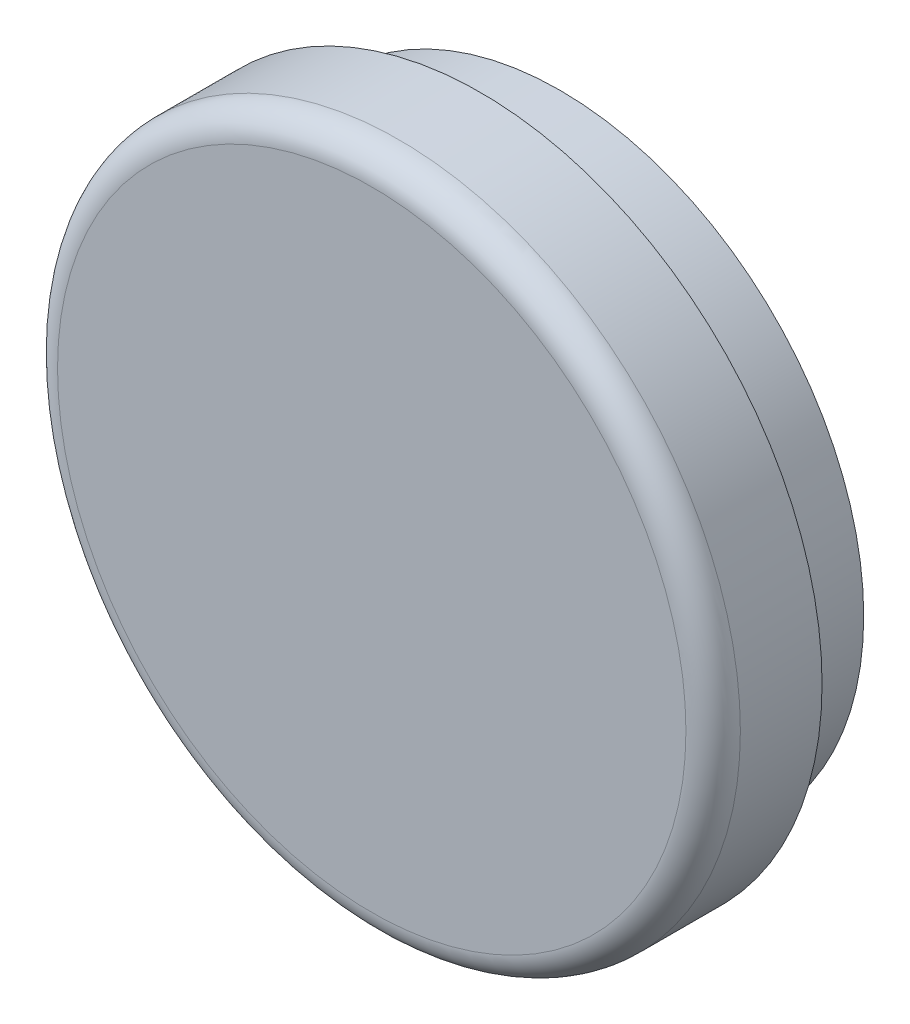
from build123d import *

# Parameters (mm, degrees)
FILLET1_R          = 6.35
SKETCH3_R          = 1.5875
CUT_EXTRUDE1_DEPTH = 6.35


with BuildPart() as part:
    # Sketch2 → Revolve1 (revolve)
    with BuildSketch(Plane(origin=(0, 0, 0), x_dir=(1, 0, 0), z_dir=(0, 1, 0))):
        Polygon((0, 0), (0, 36.83), (65.7225, 36.83), (65.7225, 41.275), (70.8025, 43.942), (70.8025, 25.4), (79.629, 25.4), (79.629, 0), align=None)
    revolve(axis=Axis((0, 0, 0), (0, 0, -1)))

    # Fillet1
    fillet1_edges = [part.edges().sort_by_distance(p)[0] for p in [
        (-79.629, 0, 0),
    ]]
    fillet(fillet1_edges, radius=FILLET1_R)

    # Sketch3 → Cut-Extrude1 (cut)
    with BuildSketch(Plane(origin=(0, 0, -36.83), x_dir=(-1, 0, 0), z_dir=(0, 0, -1))):
        with Locations((0, 50.8)):
            Circle(SKETCH3_R)
        with Locations((50.8, 0)):
            Circle(SKETCH3_R)
        with Locations((0, -50.8)):
            Circle(SKETCH3_R)
        with Locations((-50.8, 0)):
            Circle(SKETCH3_R)
    extrude(amount=-CUT_EXTRUDE1_DEPTH, mode=Mode.SUBTRACT)


solid = part.part
